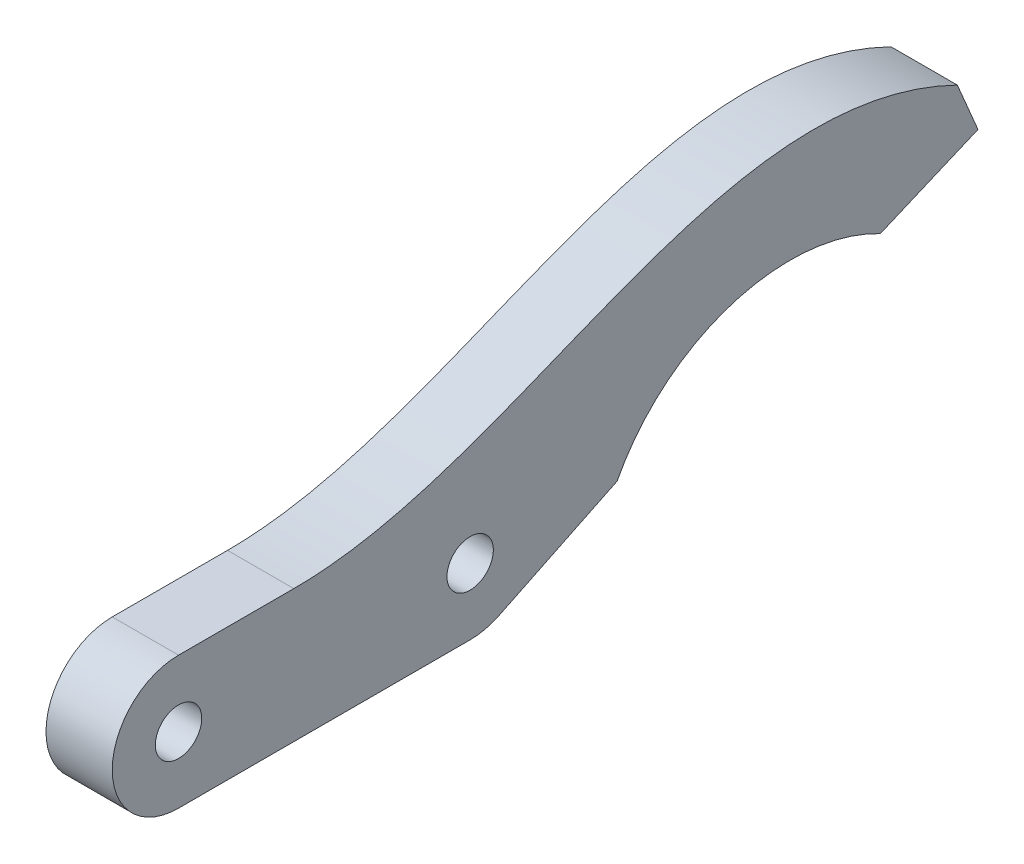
ISO-10303-21;
HEADER;
FILE_DESCRIPTION(('STEP AP214'),'2;1');
FILE_NAME('part.step','',(''),(''),'','','');
FILE_SCHEMA(('AUTOMOTIVE_DESIGN { 1 0 10303 214 1 1 1 1 }'));
ENDSEC;
DATA;
#1=APPLICATION_CONTEXT('core data for automotive mechanical design processes');
#2=APPLICATION_PROTOCOL_DEFINITION('international standard','automotive_design',2000,#1);
#3=PRODUCT_CONTEXT('',#1,'mechanical');
#4=PRODUCT('Part','Part','',(#3));
#5=PRODUCT_RELATED_PRODUCT_CATEGORY('part','',(#4));
#6=PRODUCT_DEFINITION_FORMATION('','',#4);
#7=PRODUCT_DEFINITION_CONTEXT('part definition',#1,'design');
#8=PRODUCT_DEFINITION('design','',#6,#7);
#9=PRODUCT_DEFINITION_SHAPE('','',#8);
#10=(LENGTH_UNIT() NAMED_UNIT(*) SI_UNIT(.MILLI.,.METRE.));
#11=(NAMED_UNIT(*) PLANE_ANGLE_UNIT() SI_UNIT($,.RADIAN.));
#12=(NAMED_UNIT(*) SI_UNIT($,.STERADIAN.) SOLID_ANGLE_UNIT());
#13=UNCERTAINTY_MEASURE_WITH_UNIT(LENGTH_MEASURE(1.E-05),#10,'distance_accuracy_value','');
#14=(GEOMETRIC_REPRESENTATION_CONTEXT(3) GLOBAL_UNCERTAINTY_ASSIGNED_CONTEXT((#13)) GLOBAL_UNIT_ASSIGNED_CONTEXT((#10,
#11,#12)) REPRESENTATION_CONTEXT('',''));
#15=CARTESIAN_POINT('',(0.,0.,0.));
#16=DIRECTION('',(0.,0.,1.));
#17=DIRECTION('',(1.,0.,0.));
#18=AXIS2_PLACEMENT_3D('',#15,#16,#17);
#19=CARTESIAN_POINT('',(5.,5.,-27.));
#20=DIRECTION('',(-1.,0.,0.));
#21=DIRECTION('',(0.,0.,1.));
#22=AXIS2_PLACEMENT_3D('',#19,#20,#21);
#23=CYLINDRICAL_SURFACE('',#22,5.);
#24=DIRECTION('',(1.,0.,0.));
#25=VECTOR('',#24,1.);
#26=CARTESIAN_POINT('',(0.,0.502127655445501,-29.1838370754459));
#27=LINE('',#26,#25);
#28=CARTESIAN_POINT('',(0.,0.502127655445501,-29.1838370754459));
#29=VERTEX_POINT('',#28);
#30=CARTESIAN_POINT('',(5.,0.502127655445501,-29.1838370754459));
#31=VERTEX_POINT('',#30);
#32=EDGE_CURVE('E181',#29,#31,#27,.T.);
#33=ORIENTED_EDGE('',*,*,#32,.T.);
#34=CARTESIAN_POINT('',(5.,5.,-27.));
#35=DIRECTION('',(1.,0.,0.));
#36=DIRECTION('',(0.,0.,-1.));
#37=AXIS2_PLACEMENT_3D('',#34,#35,#36);
#38=CIRCLE('',#37,5.);
#39=CARTESIAN_POINT('',(5.,0.,-27.));
#40=VERTEX_POINT('',#39);
#41=EDGE_CURVE('E197',#40,#31,#38,.T.);
#42=ORIENTED_EDGE('',*,*,#41,.F.);
#43=DIRECTION('',(-1.,0.,0.));
#44=VECTOR('',#43,1.);
#45=CARTESIAN_POINT('',(5.,0.,-27.));
#46=LINE('',#45,#44);
#47=CARTESIAN_POINT('',(0.,0.,-27.));
#48=VERTEX_POINT('',#47);
#49=EDGE_CURVE('E207',#40,#48,#46,.T.);
#50=ORIENTED_EDGE('',*,*,#49,.T.);
#51=CARTESIAN_POINT('',(0.,5.,-27.));
#52=DIRECTION('',(1.,0.,0.));
#53=DIRECTION('',(0.,0.,-1.));
#54=AXIS2_PLACEMENT_3D('',#51,#52,#53);
#55=CIRCLE('',#54,5.);
#56=EDGE_CURVE('E214',#48,#29,#55,.T.);
#57=ORIENTED_EDGE('',*,*,#56,.T.);
#58=EDGE_LOOP('',(#33,#42,#50,#57));
#59=FACE_BOUND('',#58,.T.);
#60=ADVANCED_FACE('F16',(#59),#23,.T.);
#61=CARTESIAN_POINT('',(5.,10.,0.));
#62=DIRECTION('',(0.,1.,0.));
#63=DIRECTION('',(0.,0.,1.));
#64=AXIS2_PLACEMENT_3D('',#61,#62,#63);
#65=PLANE('',#64);
#66=DIRECTION('',(1.,0.,0.));
#67=VECTOR('',#66,1.);
#68=CARTESIAN_POINT('',(0.,10.,-13.6949747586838));
#69=LINE('',#68,#67);
#70=CARTESIAN_POINT('',(0.,10.,-13.6949747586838));
#71=VERTEX_POINT('',#70);
#72=CARTESIAN_POINT('',(5.,10.,-13.6949747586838));
#73=VERTEX_POINT('',#72);
#74=EDGE_CURVE('E108',#71,#73,#69,.T.);
#75=ORIENTED_EDGE('',*,*,#74,.F.);
#76=DIRECTION('',(0.,0.,-1.));
#77=VECTOR('',#76,1.);
#78=CARTESIAN_POINT('',(0.,10.,0.));
#79=LINE('',#78,#77);
#80=CARTESIAN_POINT('',(0.,10.,-5.));
#81=VERTEX_POINT('',#80);
#82=EDGE_CURVE('E119',#81,#71,#79,.T.);
#83=ORIENTED_EDGE('',*,*,#82,.F.);
#84=DIRECTION('',(-1.,0.,0.));
#85=VECTOR('',#84,1.);
#86=CARTESIAN_POINT('',(5.,10.,-5.));
#87=LINE('',#86,#85);
#88=CARTESIAN_POINT('',(5.,10.,-5.));
#89=VERTEX_POINT('',#88);
#90=EDGE_CURVE('E11',#89,#81,#87,.T.);
#91=ORIENTED_EDGE('',*,*,#90,.F.);
#92=DIRECTION('',(0.,0.,-1.));
#93=VECTOR('',#92,1.);
#94=CARTESIAN_POINT('',(5.,10.,0.));
#95=LINE('',#94,#93);
#96=EDGE_CURVE('E179',#89,#73,#95,.T.);
#97=ORIENTED_EDGE('',*,*,#96,.T.);
#98=EDGE_LOOP('',(#75,#83,#91,#97));
#99=FACE_BOUND('',#98,.T.);
#100=ADVANCED_FACE('F18',(#99),#65,.T.);
#101=CARTESIAN_POINT('',(5.,5.,-5.));
#102=DIRECTION('',(-1.,0.,0.));
#103=DIRECTION('',(0.,0.,1.));
#104=AXIS2_PLACEMENT_3D('',#101,#102,#103);
#105=CYLINDRICAL_SURFACE('',#104,5.);
#106=CARTESIAN_POINT('',(0.,5.,-5.));
#107=DIRECTION('',(1.,0.,0.));
#108=DIRECTION('',(0.,0.,-1.));
#109=AXIS2_PLACEMENT_3D('',#106,#107,#108);
#110=CIRCLE('',#109,5.);
#111=CARTESIAN_POINT('',(0.,0.,-5.));
#112=VERTEX_POINT('',#111);
#113=EDGE_CURVE('E47',#81,#112,#110,.T.);
#114=ORIENTED_EDGE('',*,*,#113,.T.);
#115=DIRECTION('',(-1.,0.,0.));
#116=VECTOR('',#115,1.);
#117=CARTESIAN_POINT('',(5.,0.,-5.));
#118=LINE('',#117,#116);
#119=CARTESIAN_POINT('',(5.,0.,-5.));
#120=VERTEX_POINT('',#119);
#121=EDGE_CURVE('E26',#120,#112,#118,.T.);
#122=ORIENTED_EDGE('',*,*,#121,.F.);
#123=CARTESIAN_POINT('',(5.,5.,-5.));
#124=DIRECTION('',(1.,0.,0.));
#125=DIRECTION('',(0.,0.,-1.));
#126=AXIS2_PLACEMENT_3D('',#123,#124,#125);
#127=CIRCLE('',#126,5.);
#128=EDGE_CURVE('E192',#89,#120,#127,.T.);
#129=ORIENTED_EDGE('',*,*,#128,.F.);
#130=ORIENTED_EDGE('',*,*,#90,.T.);
#131=EDGE_LOOP('',(#114,#122,#129,#130));
#132=FACE_BOUND('',#131,.T.);
#133=ADVANCED_FACE('F170',(#132),#105,.T.);
#134=CARTESIAN_POINT('',(5.,0.,0.));
#135=DIRECTION('',(0.,1.,0.));
#136=DIRECTION('',(0.,0.,1.));
#137=AXIS2_PLACEMENT_3D('',#134,#135,#136);
#138=PLANE('',#137);
#139=DIRECTION('',(0.,0.,-1.));
#140=VECTOR('',#139,1.);
#141=CARTESIAN_POINT('',(0.,0.,0.));
#142=LINE('',#141,#140);
#143=EDGE_CURVE('E52',#112,#48,#142,.T.);
#144=ORIENTED_EDGE('',*,*,#143,.T.);
#145=ORIENTED_EDGE('',*,*,#49,.F.);
#146=DIRECTION('',(0.,0.,-1.));
#147=VECTOR('',#146,1.);
#148=CARTESIAN_POINT('',(5.,0.,0.));
#149=LINE('',#148,#147);
#150=EDGE_CURVE('E34',#120,#40,#149,.T.);
#151=ORIENTED_EDGE('',*,*,#150,.F.);
#152=ORIENTED_EDGE('',*,*,#121,.T.);
#153=EDGE_LOOP('',(#144,#145,#151,#152));
#154=FACE_BOUND('',#153,.T.);
#155=ADVANCED_FACE('F164',(#154),#138,.F.);
#156=CARTESIAN_POINT('',(5.,5.,-5.));
#157=DIRECTION('',(-1.,0.,0.));
#158=DIRECTION('',(0.,0.,1.));
#159=AXIS2_PLACEMENT_3D('',#156,#157,#158);
#160=CYLINDRICAL_SURFACE('',#159,1.75);
#161=CARTESIAN_POINT('',(5.,5.,-5.));
#162=DIRECTION('',(1.,0.,0.));
#163=DIRECTION('',(0.,0.,-1.));
#164=AXIS2_PLACEMENT_3D('',#161,#162,#163);
#165=CIRCLE('',#164,1.75);
#166=CARTESIAN_POINT('',(5.,5.,-6.75));
#167=VERTEX_POINT('',#166);
#168=EDGE_CURVE('E199',#167,#167,#165,.T.);
#169=ORIENTED_EDGE('',*,*,#168,.T.);
#170=EDGE_LOOP('',(#169));
#171=FACE_BOUND('',#170,.T.);
#172=CARTESIAN_POINT('',(0.,5.,-5.));
#173=DIRECTION('',(1.,0.,0.));
#174=DIRECTION('',(0.,0.,-1.));
#175=AXIS2_PLACEMENT_3D('',#172,#173,#174);
#176=CIRCLE('',#175,1.75);
#177=CARTESIAN_POINT('',(0.,5.,-6.75));
#178=VERTEX_POINT('',#177);
#179=EDGE_CURVE('E218',#178,#178,#176,.T.);
#180=ORIENTED_EDGE('',*,*,#179,.F.);
#181=EDGE_LOOP('',(#180));
#182=FACE_BOUND('',#181,.T.);
#183=ADVANCED_FACE('F160',(#171,#182),#160,.F.);
#184=CARTESIAN_POINT('',(5.,5.,-27.));
#185=DIRECTION('',(-1.,0.,0.));
#186=DIRECTION('',(0.,0.,1.));
#187=AXIS2_PLACEMENT_3D('',#184,#185,#186);
#188=CYLINDRICAL_SURFACE('',#187,1.75);
#189=CARTESIAN_POINT('',(5.,5.,-27.));
#190=DIRECTION('',(1.,0.,0.));
#191=DIRECTION('',(0.,0.,-1.));
#192=AXIS2_PLACEMENT_3D('',#189,#190,#191);
#193=CIRCLE('',#192,1.75);
#194=CARTESIAN_POINT('',(5.,5.,-28.75));
#195=VERTEX_POINT('',#194);
#196=EDGE_CURVE('E203',#195,#195,#193,.T.);
#197=ORIENTED_EDGE('',*,*,#196,.T.);
#198=EDGE_LOOP('',(#197));
#199=FACE_BOUND('',#198,.T.);
#200=CARTESIAN_POINT('',(0.,5.,-27.));
#201=DIRECTION('',(1.,0.,0.));
#202=DIRECTION('',(0.,0.,-1.));
#203=AXIS2_PLACEMENT_3D('',#200,#201,#202);
#204=CIRCLE('',#203,1.75);
#205=CARTESIAN_POINT('',(0.,5.,-28.75));
#206=VERTEX_POINT('',#205);
#207=EDGE_CURVE('E193',#206,#206,#204,.T.);
#208=ORIENTED_EDGE('',*,*,#207,.F.);
#209=EDGE_LOOP('',(#208));
#210=FACE_BOUND('',#209,.T.);
#211=ADVANCED_FACE('F155',(#199,#210),#188,.F.);
#212=CARTESIAN_POINT('',(5.,0.,0.));
#213=DIRECTION('',(1.,0.,0.));
#214=DIRECTION('',(0.,0.,-1.));
#215=AXIS2_PLACEMENT_3D('',#212,#213,#214);
#216=PLANE('',#215);
#217=ORIENTED_EDGE('',*,*,#96,.F.);
#218=ORIENTED_EDGE('',*,*,#128,.T.);
#219=ORIENTED_EDGE('',*,*,#150,.T.);
#220=ORIENTED_EDGE('',*,*,#41,.T.);
#221=DIRECTION('',(0.,0.436767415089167,-0.8995744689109));
#222=VECTOR('',#221,1.);
#223=CARTESIAN_POINT('',(5.,-11.0601312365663,-5.36998891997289));
#224=LINE('',#223,#222);
#225=CARTESIAN_POINT('',(5.,4.82408407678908,-38.0854206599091));
#226=VERTEX_POINT('',#225);
#227=EDGE_CURVE('E234',#31,#226,#224,.T.);
#228=ORIENTED_EDGE('',*,*,#227,.T.);
#229=CARTESIAN_POINT('',(5.,-1.98532600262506,-51.1385903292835));
#230=DIRECTION('',(1.,0.,0.));
#231=DIRECTION('',(0.,0.,-1.));
#232=AXIS2_PLACEMENT_3D('',#229,#230,#231);
#233=CIRCLE('',#232,14.7225440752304);
#234=CARTESIAN_POINT('',(5.,11.0678436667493,-57.9480004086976));
#235=VERTEX_POINT('',#234);
#236=EDGE_CURVE('E133',#226,#235,#233,.F.);
#237=ORIENTED_EDGE('',*,*,#236,.T.);
#238=DIRECTION('',(0.,0.39020935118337,-0.920726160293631));
#239=VECTOR('',#238,1.);
#240=CARTESIAN_POINT('',(5.,-11.4367064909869,-4.84694582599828));
#241=LINE('',#240,#239);
#242=CARTESIAN_POINT('',(5.,14.1895184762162,-65.3138096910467));
#243=VERTEX_POINT('',#242);
#244=EDGE_CURVE('E126',#235,#243,#241,.T.);
#245=ORIENTED_EDGE('',*,*,#244,.T.);
#246=DIRECTION('',(0.,0.920726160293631,0.390209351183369));
#247=VECTOR('',#246,1.);
#248=CARTESIAN_POINT('',(5.,25.6262249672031,-60.4668638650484));
#249=LINE('',#248,#247);
#250=CARTESIAN_POINT('',(5.,17.8724231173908,-63.7529722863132));
#251=VERTEX_POINT('',#250);
#252=EDGE_CURVE('E244',#243,#251,#249,.T.);
#253=ORIENTED_EDGE('',*,*,#252,.T.);
#254=CARTESIAN_POINT('',(5.,17.8724231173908,-63.7529722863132));
#255=CARTESIAN_POINT('',(5.,26.5637879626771,-45.9288826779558));
#256=CARTESIAN_POINT('',(5.,10.,-31.059268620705));
#257=CARTESIAN_POINT('',(5.,10.,-13.6949747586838));
#258=B_SPLINE_CURVE_WITH_KNOTS('',3,(#254,#255,#256,#257),.UNSPECIFIED.,.F.,.F.,(4,4),(0.,1.),.UNSPECIFIED.);
#259=EDGE_CURVE('E102',#251,#73,#258,.T.);
#260=ORIENTED_EDGE('',*,*,#259,.T.);
#261=EDGE_LOOP('',(#217,#218,#219,#220,#228,#237,#245,#253,#260));
#262=FACE_BOUND('',#261,.T.);
#263=ORIENTED_EDGE('',*,*,#168,.F.);
#264=EDGE_LOOP('',(#263));
#265=FACE_BOUND('',#264,.T.);
#266=ORIENTED_EDGE('',*,*,#196,.F.);
#267=EDGE_LOOP('',(#266));
#268=FACE_BOUND('',#267,.T.);
#269=ADVANCED_FACE('F152',(#262,#265,#268),#216,.T.);
#270=CARTESIAN_POINT('',(0.,0.,0.));
#271=DIRECTION('',(1.,0.,0.));
#272=DIRECTION('',(0.,0.,-1.));
#273=AXIS2_PLACEMENT_3D('',#270,#271,#272);
#274=PLANE('',#273);
#275=ORIENTED_EDGE('',*,*,#82,.T.);
#276=CARTESIAN_POINT('',(0.,17.8724231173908,-63.7529722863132));
#277=CARTESIAN_POINT('',(0.,26.5637879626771,-45.9288826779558));
#278=CARTESIAN_POINT('',(0.,10.,-31.059268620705));
#279=CARTESIAN_POINT('',(0.,10.,-13.6949747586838));
#280=B_SPLINE_CURVE_WITH_KNOTS('',3,(#276,#277,#278,#279),.UNSPECIFIED.,.F.,.F.,(4,4),(0.,1.),.UNSPECIFIED.);
#281=CARTESIAN_POINT('',(0.,17.8724231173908,-63.7529722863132));
#282=VERTEX_POINT('',#281);
#283=EDGE_CURVE('E99',#282,#71,#280,.T.);
#284=ORIENTED_EDGE('',*,*,#283,.F.);
#285=DIRECTION('',(0.,0.920726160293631,0.390209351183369));
#286=VECTOR('',#285,1.);
#287=CARTESIAN_POINT('',(0.,25.6262249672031,-60.4668638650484));
#288=LINE('',#287,#286);
#289=CARTESIAN_POINT('',(0.,14.1895184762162,-65.3138096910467));
#290=VERTEX_POINT('',#289);
#291=EDGE_CURVE('E117',#290,#282,#288,.T.);
#292=ORIENTED_EDGE('',*,*,#291,.F.);
#293=DIRECTION('',(0.,0.39020935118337,-0.920726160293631));
#294=VECTOR('',#293,1.);
#295=CARTESIAN_POINT('',(0.,-11.4367064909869,-4.84694582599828));
#296=LINE('',#295,#294);
#297=CARTESIAN_POINT('',(0.,11.0678436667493,-57.9480004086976));
#298=VERTEX_POINT('',#297);
#299=EDGE_CURVE('E109',#298,#290,#296,.T.);
#300=ORIENTED_EDGE('',*,*,#299,.F.);
#301=CARTESIAN_POINT('',(0.,-1.98532600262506,-51.1385903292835));
#302=DIRECTION('',(1.,0.,0.));
#303=DIRECTION('',(0.,0.,-1.));
#304=AXIS2_PLACEMENT_3D('',#301,#302,#303);
#305=CIRCLE('',#304,14.7225440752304);
#306=CARTESIAN_POINT('',(0.,4.82408407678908,-38.0854206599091));
#307=VERTEX_POINT('',#306);
#308=EDGE_CURVE('E257',#307,#298,#305,.F.);
#309=ORIENTED_EDGE('',*,*,#308,.F.);
#310=DIRECTION('',(0.,0.436767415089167,-0.8995744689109));
#311=VECTOR('',#310,1.);
#312=CARTESIAN_POINT('',(0.,-11.0601312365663,-5.36998891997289));
#313=LINE('',#312,#311);
#314=EDGE_CURVE('E121',#29,#307,#313,.T.);
#315=ORIENTED_EDGE('',*,*,#314,.F.);
#316=ORIENTED_EDGE('',*,*,#56,.F.);
#317=ORIENTED_EDGE('',*,*,#143,.F.);
#318=ORIENTED_EDGE('',*,*,#113,.F.);
#319=EDGE_LOOP('',(#275,#284,#292,#300,#309,#315,#316,#317,#318));
#320=FACE_BOUND('',#319,.T.);
#321=ORIENTED_EDGE('',*,*,#179,.T.);
#322=EDGE_LOOP('',(#321));
#323=FACE_BOUND('',#322,.T.);
#324=ORIENTED_EDGE('',*,*,#207,.T.);
#325=EDGE_LOOP('',(#324));
#326=FACE_BOUND('',#325,.T.);
#327=ADVANCED_FACE('F114',(#320,#323,#326),#274,.F.);
#328=CARTESIAN_POINT('',(0.,25.6262249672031,-60.4668638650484));
#329=DIRECTION('',(0.,0.390209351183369,-0.920726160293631));
#330=DIRECTION('',(0.,0.920726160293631,0.390209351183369));
#331=AXIS2_PLACEMENT_3D('',#328,#329,#330);
#332=PLANE('',#331);
#333=ORIENTED_EDGE('',*,*,#252,.F.);
#334=DIRECTION('',(1.,0.,0.));
#335=VECTOR('',#334,1.);
#336=CARTESIAN_POINT('',(0.,14.1895184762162,-65.3138096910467));
#337=LINE('',#336,#335);
#338=EDGE_CURVE('E124',#290,#243,#337,.T.);
#339=ORIENTED_EDGE('',*,*,#338,.F.);
#340=ORIENTED_EDGE('',*,*,#291,.T.);
#341=DIRECTION('',(1.,0.,0.));
#342=VECTOR('',#341,1.);
#343=CARTESIAN_POINT('',(0.,17.8724231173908,-63.7529722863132));
#344=LINE('',#343,#342);
#345=EDGE_CURVE('E96',#282,#251,#344,.T.);
#346=ORIENTED_EDGE('',*,*,#345,.T.);
#347=EDGE_LOOP('',(#333,#339,#340,#346));
#348=FACE_BOUND('',#347,.T.);
#349=ADVANCED_FACE('F123',(#348),#332,.T.);
#350=CARTESIAN_POINT('',(0.,-11.4367064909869,-4.84694582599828));
#351=DIRECTION('',(0.,-0.920726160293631,-0.39020935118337));
#352=DIRECTION('',(0.,0.39020935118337,-0.920726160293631));
#353=AXIS2_PLACEMENT_3D('',#350,#351,#352);
#354=PLANE('',#353);
#355=ORIENTED_EDGE('',*,*,#244,.F.);
#356=DIRECTION('',(1.,0.,0.));
#357=VECTOR('',#356,1.);
#358=CARTESIAN_POINT('',(0.,11.0678436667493,-57.9480004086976));
#359=LINE('',#358,#357);
#360=EDGE_CURVE('E251',#298,#235,#359,.T.);
#361=ORIENTED_EDGE('',*,*,#360,.F.);
#362=ORIENTED_EDGE('',*,*,#299,.T.);
#363=ORIENTED_EDGE('',*,*,#338,.T.);
#364=EDGE_LOOP('',(#355,#361,#362,#363));
#365=FACE_BOUND('',#364,.T.);
#366=ADVANCED_FACE('F151',(#365),#354,.T.);
#367=CARTESIAN_POINT('',(0.,-1.98532600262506,-51.1385903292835));
#368=DIRECTION('',(1.,0.,0.));
#369=DIRECTION('',(0.,0.,-1.));
#370=AXIS2_PLACEMENT_3D('',#367,#368,#369);
#371=CYLINDRICAL_SURFACE('',#370,14.7225440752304);
#372=ORIENTED_EDGE('',*,*,#236,.F.);
#373=DIRECTION('',(1.,0.,0.));
#374=VECTOR('',#373,1.);
#375=CARTESIAN_POINT('',(0.,4.82408407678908,-38.0854206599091));
#376=LINE('',#375,#374);
#377=EDGE_CURVE('E187',#307,#226,#376,.T.);
#378=ORIENTED_EDGE('',*,*,#377,.F.);
#379=ORIENTED_EDGE('',*,*,#308,.T.);
#380=ORIENTED_EDGE('',*,*,#360,.T.);
#381=EDGE_LOOP('',(#372,#378,#379,#380));
#382=FACE_BOUND('',#381,.T.);
#383=ADVANCED_FACE('F256',(#382),#371,.F.);
#384=CARTESIAN_POINT('',(0.,-11.0601312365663,-5.36998891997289));
#385=DIRECTION('',(0.,-0.8995744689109,-0.436767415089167));
#386=DIRECTION('',(0.,0.436767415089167,-0.8995744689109));
#387=AXIS2_PLACEMENT_3D('',#384,#385,#386);
#388=PLANE('',#387);
#389=ORIENTED_EDGE('',*,*,#227,.F.);
#390=ORIENTED_EDGE('',*,*,#32,.F.);
#391=ORIENTED_EDGE('',*,*,#314,.T.);
#392=ORIENTED_EDGE('',*,*,#377,.T.);
#393=EDGE_LOOP('',(#389,#390,#391,#392));
#394=FACE_BOUND('',#393,.T.);
#395=ADVANCED_FACE('F147',(#394),#388,.T.);
#396=DIRECTION('',(1.,0.,0.));
#397=VECTOR('',#396,1.);
#398=SURFACE_OF_LINEAR_EXTRUSION('',#280,#397);
#399=ORIENTED_EDGE('',*,*,#259,.F.);
#400=ORIENTED_EDGE('',*,*,#345,.F.);
#401=ORIENTED_EDGE('',*,*,#283,.T.);
#402=ORIENTED_EDGE('',*,*,#74,.T.);
#403=EDGE_LOOP('',(#399,#400,#401,#402));
#404=FACE_BOUND('',#403,.T.);
#405=ADVANCED_FACE('F98',(#404),#398,.T.);
#406=CLOSED_SHELL('',(#60,#100,#133,#155,#183,#211,#269,#327,#349,#366,#383,#395,#405));
#407=MANIFOLD_SOLID_BREP('B1',#406);
#408=ADVANCED_BREP_SHAPE_REPRESENTATION('',(#18,#407),#14);
#409=SHAPE_DEFINITION_REPRESENTATION(#9,#408);
ENDSEC;
END-ISO-10303-21;
